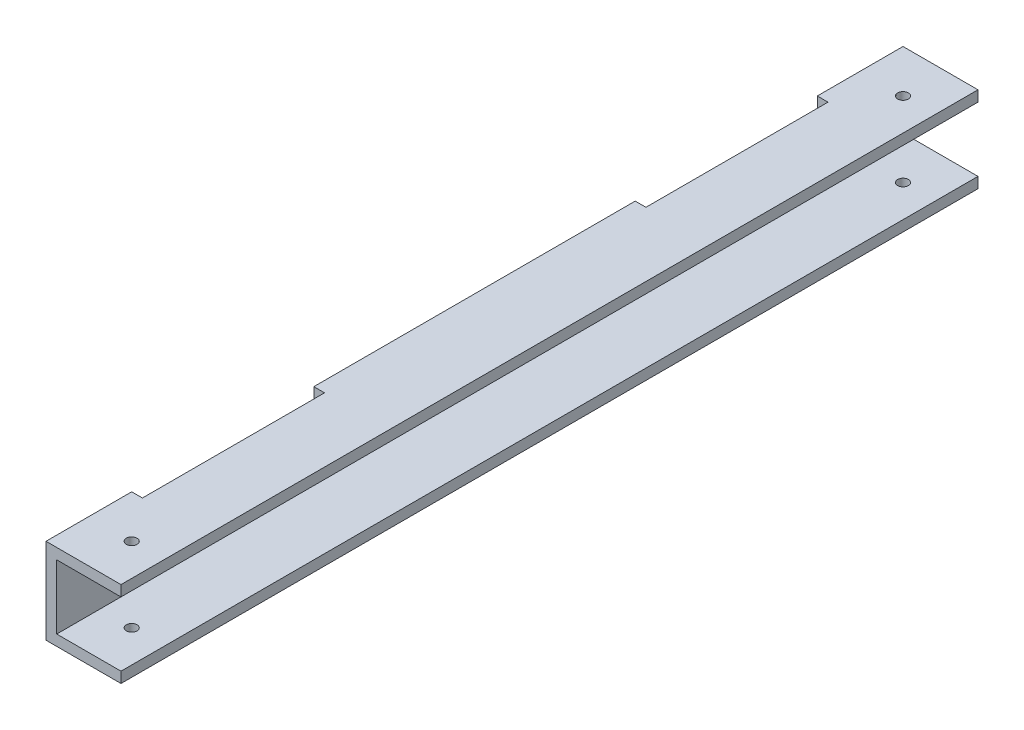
ISO-10303-21;
HEADER;
FILE_DESCRIPTION(('STEP AP214'),'2;1');
FILE_NAME('part.step','',(''),(''),'','','');
FILE_SCHEMA(('AUTOMOTIVE_DESIGN { 1 0 10303 214 1 1 1 1 }'));
ENDSEC;
DATA;
#1=APPLICATION_CONTEXT('core data for automotive mechanical design processes');
#2=APPLICATION_PROTOCOL_DEFINITION('international standard','automotive_design',2000,#1);
#3=PRODUCT_CONTEXT('',#1,'mechanical');
#4=PRODUCT('Part','Part','',(#3));
#5=PRODUCT_RELATED_PRODUCT_CATEGORY('part','',(#4));
#6=PRODUCT_DEFINITION_FORMATION('','',#4);
#7=PRODUCT_DEFINITION_CONTEXT('part definition',#1,'design');
#8=PRODUCT_DEFINITION('design','',#6,#7);
#9=PRODUCT_DEFINITION_SHAPE('','',#8);
#10=(LENGTH_UNIT() NAMED_UNIT(*) SI_UNIT(.MILLI.,.METRE.));
#11=(NAMED_UNIT(*) PLANE_ANGLE_UNIT() SI_UNIT($,.RADIAN.));
#12=(NAMED_UNIT(*) SI_UNIT($,.STERADIAN.) SOLID_ANGLE_UNIT());
#13=UNCERTAINTY_MEASURE_WITH_UNIT(LENGTH_MEASURE(1.E-05),#10,'distance_accuracy_value','');
#14=(GEOMETRIC_REPRESENTATION_CONTEXT(3) GLOBAL_UNCERTAINTY_ASSIGNED_CONTEXT((#13)) GLOBAL_UNIT_ASSIGNED_CONTEXT((#10,
#11,#12)) REPRESENTATION_CONTEXT('',''));
#15=CARTESIAN_POINT('',(0.,0.,0.));
#16=DIRECTION('',(0.,0.,1.));
#17=DIRECTION('',(1.,0.,0.));
#18=AXIS2_PLACEMENT_3D('',#15,#16,#17);
#19=CARTESIAN_POINT('',(-11.1125,-12.7,254.));
#20=DIRECTION('',(1.,0.,0.));
#21=DIRECTION('',(0.,0.,-1.));
#22=AXIS2_PLACEMENT_3D('',#19,#20,#21);
#23=PLANE('',#22);
#24=CARTESIAN_POINT('',(-11.1125,0.,161.925));
#25=DIRECTION('',(-1.,0.,0.));
#26=DIRECTION('',(0.,0.,-1.));
#27=AXIS2_PLACEMENT_3D('',#24,#25,#26);
#28=CIRCLE('',#27,1.58750000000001);
#29=CARTESIAN_POINT('',(-11.1125,0.,160.3375));
#30=VERTEX_POINT('',#29);
#31=EDGE_CURVE('E588',#30,#30,#28,.T.);
#32=ORIENTED_EDGE('',*,*,#31,.F.);
#33=EDGE_LOOP('',(#32));
#34=FACE_BOUND('',#33,.T.);
#35=CARTESIAN_POINT('',(-11.1125,0.,92.075));
#36=DIRECTION('',(-1.,0.,0.));
#37=DIRECTION('',(0.,0.,1.));
#38=AXIS2_PLACEMENT_3D('',#35,#36,#37);
#39=CIRCLE('',#38,1.5875);
#40=CARTESIAN_POINT('',(-11.1125,0.,93.6625));
#41=VERTEX_POINT('',#40);
#42=EDGE_CURVE('E587',#41,#41,#39,.T.);
#43=ORIENTED_EDGE('',*,*,#42,.F.);
#44=EDGE_LOOP('',(#43));
#45=FACE_BOUND('',#44,.T.);
#46=DIRECTION('',(0.,0.,-1.));
#47=VECTOR('',#46,1.);
#48=CARTESIAN_POINT('',(-11.1125,12.7,254.));
#49=LINE('',#48,#47);
#50=CARTESIAN_POINT('',(-11.1125,12.7,174.625));
#51=VERTEX_POINT('',#50);
#52=CARTESIAN_POINT('',(-11.1125,12.7,79.375));
#53=VERTEX_POINT('',#52);
#54=EDGE_CURVE('E364',#51,#53,#49,.T.);
#55=ORIENTED_EDGE('',*,*,#54,.T.);
#56=DIRECTION('',(0.,1.,0.));
#57=VECTOR('',#56,1.);
#58=CARTESIAN_POINT('',(-11.1125,-12.7,79.375));
#59=LINE('',#58,#57);
#60=CARTESIAN_POINT('',(-11.1125,-12.7,79.375));
#61=VERTEX_POINT('',#60);
#62=EDGE_CURVE('E230',#61,#53,#59,.T.);
#63=ORIENTED_EDGE('',*,*,#62,.F.);
#64=DIRECTION('',(0.,0.,-1.));
#65=VECTOR('',#64,1.);
#66=CARTESIAN_POINT('',(-11.1125,-12.7,254.));
#67=LINE('',#66,#65);
#68=CARTESIAN_POINT('',(-11.1125,-12.7,174.625));
#69=VERTEX_POINT('',#68);
#70=EDGE_CURVE('E49',#69,#61,#67,.T.);
#71=ORIENTED_EDGE('',*,*,#70,.F.);
#72=DIRECTION('',(0.,1.,0.));
#73=VECTOR('',#72,1.);
#74=CARTESIAN_POINT('',(-11.1125,-12.7,174.625));
#75=LINE('',#74,#73);
#76=EDGE_CURVE('E222',#69,#51,#75,.T.);
#77=ORIENTED_EDGE('',*,*,#76,.T.);
#78=EDGE_LOOP('',(#55,#63,#71,#77));
#79=FACE_BOUND('',#78,.T.);
#80=ADVANCED_FACE('F39',(#34,#45,#79),#23,.F.);
#81=CARTESIAN_POINT('',(-11.1125,0.,12.7));
#82=DIRECTION('',(-1.,0.,0.));
#83=DIRECTION('',(0.,0.,1.));
#84=AXIS2_PLACEMENT_3D('',#81,#82,#83);
#85=CIRCLE('',#84,1.58749999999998);
#86=CARTESIAN_POINT('',(-11.1125,0.,14.2875));
#87=VERTEX_POINT('',#86);
#88=EDGE_CURVE('E397',#87,#87,#85,.T.);
#89=ORIENTED_EDGE('',*,*,#88,.F.);
#90=EDGE_LOOP('',(#89));
#91=FACE_BOUND('',#90,.T.);
#92=CARTESIAN_POINT('',(-11.1125,-12.7,25.4));
#93=VERTEX_POINT('',#92);
#94=CARTESIAN_POINT('',(-11.1125,-12.7,0.));
#95=VERTEX_POINT('',#94);
#96=EDGE_CURVE('E51',#93,#95,#67,.T.);
#97=ORIENTED_EDGE('',*,*,#96,.F.);
#98=DIRECTION('',(0.,1.,0.));
#99=VECTOR('',#98,1.);
#100=CARTESIAN_POINT('',(-11.1125,-12.7,25.4));
#101=LINE('',#100,#99);
#102=CARTESIAN_POINT('',(-11.1125,12.7,25.4));
#103=VERTEX_POINT('',#102);
#104=EDGE_CURVE('E192',#93,#103,#101,.T.);
#105=ORIENTED_EDGE('',*,*,#104,.T.);
#106=CARTESIAN_POINT('',(-11.1125,12.7,0.));
#107=VERTEX_POINT('',#106);
#108=EDGE_CURVE('E332',#103,#107,#49,.T.);
#109=ORIENTED_EDGE('',*,*,#108,.T.);
#110=DIRECTION('',(0.,-1.,0.));
#111=VECTOR('',#110,1.);
#112=CARTESIAN_POINT('',(-11.1125,-12.7,0.));
#113=LINE('',#112,#111);
#114=EDGE_CURVE('E305',#107,#95,#113,.T.);
#115=ORIENTED_EDGE('',*,*,#114,.T.);
#116=EDGE_LOOP('',(#97,#105,#109,#115));
#117=FACE_BOUND('',#116,.T.);
#118=ADVANCED_FACE('F425',(#91,#117),#23,.F.);
#119=CARTESIAN_POINT('',(-7.9375,9.52499999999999,254.));
#120=DIRECTION('',(-1.,0.,0.));
#121=DIRECTION('',(0.,-1.,0.));
#122=AXIS2_PLACEMENT_3D('',#119,#120,#121);
#123=PLANE('',#122);
#124=CARTESIAN_POINT('',(-7.9375,0.,161.925));
#125=DIRECTION('',(-1.,0.,0.));
#126=DIRECTION('',(0.,-1.,0.));
#127=AXIS2_PLACEMENT_3D('',#124,#125,#126);
#128=CIRCLE('',#127,1.58750000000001);
#129=CARTESIAN_POINT('',(-7.9375,-1.58750000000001,161.925));
#130=VERTEX_POINT('',#129);
#131=EDGE_CURVE('E43',#130,#130,#128,.T.);
#132=ORIENTED_EDGE('',*,*,#131,.T.);
#133=EDGE_LOOP('',(#132));
#134=FACE_BOUND('',#133,.T.);
#135=CARTESIAN_POINT('',(-7.9375,0.,92.075));
#136=DIRECTION('',(-1.,0.,0.));
#137=DIRECTION('',(0.,-1.,0.));
#138=AXIS2_PLACEMENT_3D('',#135,#136,#137);
#139=CIRCLE('',#138,1.5875);
#140=CARTESIAN_POINT('',(-7.9375,-1.5875,92.075));
#141=VERTEX_POINT('',#140);
#142=EDGE_CURVE('E400',#141,#141,#139,.T.);
#143=ORIENTED_EDGE('',*,*,#142,.T.);
#144=EDGE_LOOP('',(#143));
#145=FACE_BOUND('',#144,.T.);
#146=DIRECTION('',(0.,0.,-1.));
#147=VECTOR('',#146,1.);
#148=CARTESIAN_POINT('',(-7.9375,-9.525,254.));
#149=LINE('',#148,#147);
#150=CARTESIAN_POINT('',(-7.9375,-9.525,174.625));
#151=VERTEX_POINT('',#150);
#152=CARTESIAN_POINT('',(-7.9375,-9.525,79.375));
#153=VERTEX_POINT('',#152);
#154=EDGE_CURVE('E384',#151,#153,#149,.T.);
#155=ORIENTED_EDGE('',*,*,#154,.T.);
#156=DIRECTION('',(0.,1.,0.));
#157=VECTOR('',#156,1.);
#158=CARTESIAN_POINT('',(-7.9375,-12.7,79.375));
#159=LINE('',#158,#157);
#160=CARTESIAN_POINT('',(-7.9375,9.525,79.375));
#161=VERTEX_POINT('',#160);
#162=EDGE_CURVE('E228',#153,#161,#159,.T.);
#163=ORIENTED_EDGE('',*,*,#162,.T.);
#164=DIRECTION('',(0.,0.,-1.));
#165=VECTOR('',#164,1.);
#166=CARTESIAN_POINT('',(-7.9375,9.52499999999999,254.));
#167=LINE('',#166,#165);
#168=CARTESIAN_POINT('',(-7.9375,9.52499999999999,174.625));
#169=VERTEX_POINT('',#168);
#170=EDGE_CURVE('E378',#169,#161,#167,.T.);
#171=ORIENTED_EDGE('',*,*,#170,.F.);
#172=DIRECTION('',(0.,1.,0.));
#173=VECTOR('',#172,1.);
#174=CARTESIAN_POINT('',(-7.9375,-12.7,174.625));
#175=LINE('',#174,#173);
#176=EDGE_CURVE('E66',#151,#169,#175,.T.);
#177=ORIENTED_EDGE('',*,*,#176,.F.);
#178=EDGE_LOOP('',(#155,#163,#171,#177));
#179=FACE_BOUND('',#178,.T.);
#180=ADVANCED_FACE('F409',(#134,#145,#179),#123,.F.);
#181=CARTESIAN_POINT('',(-7.9375,0.,12.7));
#182=DIRECTION('',(-1.,0.,0.));
#183=DIRECTION('',(0.,-1.,0.));
#184=AXIS2_PLACEMENT_3D('',#181,#182,#183);
#185=CIRCLE('',#184,1.58749999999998);
#186=CARTESIAN_POINT('',(-7.9375,-1.58749999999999,12.7));
#187=VERTEX_POINT('',#186);
#188=EDGE_CURVE('E396',#187,#187,#185,.T.);
#189=ORIENTED_EDGE('',*,*,#188,.T.);
#190=EDGE_LOOP('',(#189));
#191=FACE_BOUND('',#190,.T.);
#192=CARTESIAN_POINT('',(-7.9375,9.52499999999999,25.4));
#193=VERTEX_POINT('',#192);
#194=CARTESIAN_POINT('',(-7.9375,9.52499999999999,0.));
#195=VERTEX_POINT('',#194);
#196=EDGE_CURVE('E372',#193,#195,#167,.T.);
#197=ORIENTED_EDGE('',*,*,#196,.F.);
#198=DIRECTION('',(0.,1.,0.));
#199=VECTOR('',#198,1.);
#200=CARTESIAN_POINT('',(-7.93750000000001,-12.7,25.4));
#201=LINE('',#200,#199);
#202=CARTESIAN_POINT('',(-7.93750000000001,-9.525,25.4));
#203=VERTEX_POINT('',#202);
#204=EDGE_CURVE('E58',#203,#193,#201,.T.);
#205=ORIENTED_EDGE('',*,*,#204,.F.);
#206=CARTESIAN_POINT('',(-7.9375,-9.525,0.));
#207=VERTEX_POINT('',#206);
#208=EDGE_CURVE('E377',#203,#207,#149,.T.);
#209=ORIENTED_EDGE('',*,*,#208,.T.);
#210=DIRECTION('',(0.,1.,0.));
#211=VECTOR('',#210,1.);
#212=CARTESIAN_POINT('',(-7.9375,9.52499999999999,0.));
#213=LINE('',#212,#211);
#214=EDGE_CURVE('E346',#207,#195,#213,.T.);
#215=ORIENTED_EDGE('',*,*,#214,.T.);
#216=EDGE_LOOP('',(#197,#205,#209,#215));
#217=FACE_BOUND('',#216,.T.);
#218=ADVANCED_FACE('F434',(#191,#217),#123,.F.);
#219=CARTESIAN_POINT('',(-11.1125,0.,241.3));
#220=DIRECTION('',(-1.,0.,0.));
#221=DIRECTION('',(0.,0.,-1.));
#222=AXIS2_PLACEMENT_3D('',#219,#220,#221);
#223=CIRCLE('',#222,1.58749999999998);
#224=CARTESIAN_POINT('',(-11.1125,0.,239.7125));
#225=VERTEX_POINT('',#224);
#226=EDGE_CURVE('E448',#225,#225,#223,.T.);
#227=ORIENTED_EDGE('',*,*,#226,.F.);
#228=EDGE_LOOP('',(#227));
#229=FACE_BOUND('',#228,.T.);
#230=CARTESIAN_POINT('',(-11.1125,12.7,254.));
#231=VERTEX_POINT('',#230);
#232=CARTESIAN_POINT('',(-11.1125,12.7,228.6));
#233=VERTEX_POINT('',#232);
#234=EDGE_CURVE('E359',#231,#233,#49,.T.);
#235=ORIENTED_EDGE('',*,*,#234,.T.);
#236=DIRECTION('',(0.,1.,0.));
#237=VECTOR('',#236,1.);
#238=CARTESIAN_POINT('',(-11.1125,-12.7,228.6));
#239=LINE('',#238,#237);
#240=CARTESIAN_POINT('',(-11.1125,-12.7,228.6));
#241=VERTEX_POINT('',#240);
#242=EDGE_CURVE('E248',#241,#233,#239,.T.);
#243=ORIENTED_EDGE('',*,*,#242,.F.);
#244=CARTESIAN_POINT('',(-11.1125,-12.7,254.));
#245=VERTEX_POINT('',#244);
#246=EDGE_CURVE('E11',#245,#241,#67,.T.);
#247=ORIENTED_EDGE('',*,*,#246,.F.);
#248=DIRECTION('',(0.,-1.,0.));
#249=VECTOR('',#248,1.);
#250=CARTESIAN_POINT('',(-11.1125,-12.7,254.));
#251=LINE('',#250,#249);
#252=EDGE_CURVE('E306',#231,#245,#251,.T.);
#253=ORIENTED_EDGE('',*,*,#252,.F.);
#254=EDGE_LOOP('',(#235,#243,#247,#253));
#255=FACE_BOUND('',#254,.T.);
#256=ADVANCED_FACE('F41',(#229,#255),#23,.F.);
#257=CARTESIAN_POINT('',(11.1125,-12.7,254.));
#258=DIRECTION('',(0.,1.,0.));
#259=DIRECTION('',(0.,0.,1.));
#260=AXIS2_PLACEMENT_3D('',#257,#258,#259);
#261=PLANE('',#260);
#262=CARTESIAN_POINT('',(1.5875,-12.7,241.3));
#263=DIRECTION('',(0.,1.,0.));
#264=DIRECTION('',(0.,0.,1.));
#265=AXIS2_PLACEMENT_3D('',#262,#263,#264);
#266=CIRCLE('',#265,1.5875);
#267=CARTESIAN_POINT('',(1.5875,-12.7,242.8875));
#268=VERTEX_POINT('',#267);
#269=EDGE_CURVE('E279',#268,#268,#266,.T.);
#270=ORIENTED_EDGE('',*,*,#269,.T.);
#271=EDGE_LOOP('',(#270));
#272=FACE_BOUND('',#271,.T.);
#273=CARTESIAN_POINT('',(1.5875,-12.7,12.7));
#274=DIRECTION('',(0.,1.,0.));
#275=DIRECTION('',(0.,0.,1.));
#276=AXIS2_PLACEMENT_3D('',#273,#274,#275);
#277=CIRCLE('',#276,1.5875);
#278=CARTESIAN_POINT('',(1.5875,-12.7,14.2875));
#279=VERTEX_POINT('',#278);
#280=EDGE_CURVE('E602',#279,#279,#277,.T.);
#281=ORIENTED_EDGE('',*,*,#280,.T.);
#282=EDGE_LOOP('',(#281));
#283=FACE_BOUND('',#282,.T.);
#284=ORIENTED_EDGE('',*,*,#70,.T.);
#285=DIRECTION('',(1.,0.,0.));
#286=VECTOR('',#285,1.);
#287=CARTESIAN_POINT('',(-7.9375,-12.7,79.375));
#288=LINE('',#287,#286);
#289=CARTESIAN_POINT('',(-7.9375,-12.7,79.375));
#290=VERTEX_POINT('',#289);
#291=EDGE_CURVE('E202',#61,#290,#288,.T.);
#292=ORIENTED_EDGE('',*,*,#291,.T.);
#293=DIRECTION('',(0.,0.,-1.));
#294=VECTOR('',#293,1.);
#295=CARTESIAN_POINT('',(-7.93750000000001,-12.7,25.4));
#296=LINE('',#295,#294);
#297=CARTESIAN_POINT('',(-7.93750000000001,-12.7,25.4));
#298=VERTEX_POINT('',#297);
#299=EDGE_CURVE('E187',#290,#298,#296,.T.);
#300=ORIENTED_EDGE('',*,*,#299,.T.);
#301=DIRECTION('',(-1.,0.,0.));
#302=VECTOR('',#301,1.);
#303=CARTESIAN_POINT('',(-7.93750000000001,-12.7,25.4));
#304=LINE('',#303,#302);
#305=EDGE_CURVE('E196',#298,#93,#304,.T.);
#306=ORIENTED_EDGE('',*,*,#305,.T.);
#307=ORIENTED_EDGE('',*,*,#96,.T.);
#308=DIRECTION('',(1.,0.,0.));
#309=VECTOR('',#308,1.);
#310=CARTESIAN_POINT('',(11.1125,-12.7,0.));
#311=LINE('',#310,#309);
#312=CARTESIAN_POINT('',(11.1125,-12.7,0.));
#313=VERTEX_POINT('',#312);
#314=EDGE_CURVE('E336',#95,#313,#311,.T.);
#315=ORIENTED_EDGE('',*,*,#314,.T.);
#316=DIRECTION('',(0.,0.,-1.));
#317=VECTOR('',#316,1.);
#318=CARTESIAN_POINT('',(11.1125,-12.7,254.));
#319=LINE('',#318,#317);
#320=CARTESIAN_POINT('',(11.1125,-12.7,254.));
#321=VERTEX_POINT('',#320);
#322=EDGE_CURVE('E388',#321,#313,#319,.T.);
#323=ORIENTED_EDGE('',*,*,#322,.F.);
#324=DIRECTION('',(1.,0.,0.));
#325=VECTOR('',#324,1.);
#326=CARTESIAN_POINT('',(11.1125,-12.7,254.));
#327=LINE('',#326,#325);
#328=EDGE_CURVE('E310',#245,#321,#327,.T.);
#329=ORIENTED_EDGE('',*,*,#328,.F.);
#330=ORIENTED_EDGE('',*,*,#246,.T.);
#331=DIRECTION('',(1.,0.,0.));
#332=VECTOR('',#331,1.);
#333=CARTESIAN_POINT('',(-11.1125,-12.7,228.6));
#334=LINE('',#333,#332);
#335=CARTESIAN_POINT('',(-7.9375,-12.7,228.6));
#336=VERTEX_POINT('',#335);
#337=EDGE_CURVE('E235',#241,#336,#334,.T.);
#338=ORIENTED_EDGE('',*,*,#337,.T.);
#339=DIRECTION('',(0.,0.,-1.));
#340=VECTOR('',#339,1.);
#341=CARTESIAN_POINT('',(-7.9375,-12.7,228.6));
#342=LINE('',#341,#340);
#343=CARTESIAN_POINT('',(-7.9375,-12.7,174.625));
#344=VERTEX_POINT('',#343);
#345=EDGE_CURVE('E239',#336,#344,#342,.T.);
#346=ORIENTED_EDGE('',*,*,#345,.T.);
#347=DIRECTION('',(-1.,0.,0.));
#348=VECTOR('',#347,1.);
#349=CARTESIAN_POINT('',(-11.1125,-12.7,174.625));
#350=LINE('',#349,#348);
#351=EDGE_CURVE('E244',#344,#69,#350,.T.);
#352=ORIENTED_EDGE('',*,*,#351,.T.);
#353=EDGE_LOOP('',(#284,#292,#300,#306,#307,#315,#323,#329,#330,#338,#346,#352));
#354=FACE_BOUND('',#353,.T.);
#355=ADVANCED_FACE('F205',(#272,#283,#354),#261,.F.);
#356=CARTESIAN_POINT('',(11.1125,-12.7,254.));
#357=DIRECTION('',(-1.,0.,0.));
#358=DIRECTION('',(0.,-1.,0.));
#359=AXIS2_PLACEMENT_3D('',#356,#357,#358);
#360=PLANE('',#359);
#361=DIRECTION('',(0.,1.,0.));
#362=VECTOR('',#361,1.);
#363=CARTESIAN_POINT('',(11.1125,-12.7,0.));
#364=LINE('',#363,#362);
#365=CARTESIAN_POINT('',(11.1125,-9.525,0.));
#366=VERTEX_POINT('',#365);
#367=EDGE_CURVE('E339',#313,#366,#364,.T.);
#368=ORIENTED_EDGE('',*,*,#367,.T.);
#369=DIRECTION('',(0.,0.,-1.));
#370=VECTOR('',#369,1.);
#371=CARTESIAN_POINT('',(11.1125,-9.525,254.));
#372=LINE('',#371,#370);
#373=CARTESIAN_POINT('',(11.1125,-9.525,254.));
#374=VERTEX_POINT('',#373);
#375=EDGE_CURVE('E383',#374,#366,#372,.T.);
#376=ORIENTED_EDGE('',*,*,#375,.F.);
#377=DIRECTION('',(0.,1.,0.));
#378=VECTOR('',#377,1.);
#379=CARTESIAN_POINT('',(11.1125,-12.7,254.));
#380=LINE('',#379,#378);
#381=EDGE_CURVE('E314',#321,#374,#380,.T.);
#382=ORIENTED_EDGE('',*,*,#381,.F.);
#383=ORIENTED_EDGE('',*,*,#322,.T.);
#384=EDGE_LOOP('',(#368,#376,#382,#383));
#385=FACE_BOUND('',#384,.T.);
#386=ADVANCED_FACE('F440',(#385),#360,.F.);
#387=CARTESIAN_POINT('',(-7.9375,-9.525,254.));
#388=DIRECTION('',(0.,-1.,0.));
#389=DIRECTION('',(0.,0.,-1.));
#390=AXIS2_PLACEMENT_3D('',#387,#388,#389);
#391=PLANE('',#390);
#392=CARTESIAN_POINT('',(1.5875,-9.525,241.3));
#393=DIRECTION('',(0.,-1.,0.));
#394=DIRECTION('',(0.,0.,-1.));
#395=AXIS2_PLACEMENT_3D('',#392,#393,#394);
#396=CIRCLE('',#395,1.5875);
#397=CARTESIAN_POINT('',(1.5875,-9.525,239.7125));
#398=VERTEX_POINT('',#397);
#399=EDGE_CURVE('E301',#398,#398,#396,.T.);
#400=ORIENTED_EDGE('',*,*,#399,.T.);
#401=EDGE_LOOP('',(#400));
#402=FACE_BOUND('',#401,.T.);
#403=CARTESIAN_POINT('',(1.5875,-9.525,12.7));
#404=DIRECTION('',(0.,-1.,0.));
#405=DIRECTION('',(0.,0.,-1.));
#406=AXIS2_PLACEMENT_3D('',#403,#404,#405);
#407=CIRCLE('',#406,1.5875);
#408=CARTESIAN_POINT('',(1.5875,-9.525,11.1125));
#409=VERTEX_POINT('',#408);
#410=EDGE_CURVE('E293',#409,#409,#407,.T.);
#411=ORIENTED_EDGE('',*,*,#410,.T.);
#412=EDGE_LOOP('',(#411));
#413=FACE_BOUND('',#412,.T.);
#414=DIRECTION('',(-1.,0.,0.));
#415=VECTOR('',#414,1.);
#416=CARTESIAN_POINT('',(-7.9375,-9.525,0.));
#417=LINE('',#416,#415);
#418=EDGE_CURVE('E342',#366,#207,#417,.T.);
#419=ORIENTED_EDGE('',*,*,#418,.T.);
#420=ORIENTED_EDGE('',*,*,#208,.F.);
#421=DIRECTION('',(0.,0.,1.));
#422=VECTOR('',#421,1.);
#423=CARTESIAN_POINT('',(-7.9375,-9.525,254.));
#424=LINE('',#423,#422);
#425=EDGE_CURVE('E190',#203,#153,#424,.T.);
#426=ORIENTED_EDGE('',*,*,#425,.T.);
#427=ORIENTED_EDGE('',*,*,#154,.F.);
#428=DIRECTION('',(0.,0.,1.));
#429=VECTOR('',#428,1.);
#430=CARTESIAN_POINT('',(-7.9375,-9.525,254.));
#431=LINE('',#430,#429);
#432=CARTESIAN_POINT('',(-7.9375,-9.525,228.6));
#433=VERTEX_POINT('',#432);
#434=EDGE_CURVE('E278',#151,#433,#431,.T.);
#435=ORIENTED_EDGE('',*,*,#434,.T.);
#436=CARTESIAN_POINT('',(-7.9375,-9.525,254.));
#437=VERTEX_POINT('',#436);
#438=EDGE_CURVE('E379',#437,#433,#149,.T.);
#439=ORIENTED_EDGE('',*,*,#438,.F.);
#440=DIRECTION('',(-1.,0.,0.));
#441=VECTOR('',#440,1.);
#442=CARTESIAN_POINT('',(-7.9375,-9.525,254.));
#443=LINE('',#442,#441);
#444=EDGE_CURVE('E317',#374,#437,#443,.T.);
#445=ORIENTED_EDGE('',*,*,#444,.F.);
#446=ORIENTED_EDGE('',*,*,#375,.T.);
#447=EDGE_LOOP('',(#419,#420,#426,#427,#435,#439,#445,#446));
#448=FACE_BOUND('',#447,.T.);
#449=ADVANCED_FACE('F502',(#402,#413,#448),#391,.F.);
#450=CARTESIAN_POINT('',(-7.9375,0.,241.3));
#451=DIRECTION('',(-1.,0.,0.));
#452=DIRECTION('',(0.,-1.,0.));
#453=AXIS2_PLACEMENT_3D('',#450,#451,#452);
#454=CIRCLE('',#453,1.58749999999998);
#455=CARTESIAN_POINT('',(-7.9375,-1.58749999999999,241.3));
#456=VERTEX_POINT('',#455);
#457=EDGE_CURVE('E392',#456,#456,#454,.T.);
#458=ORIENTED_EDGE('',*,*,#457,.T.);
#459=EDGE_LOOP('',(#458));
#460=FACE_BOUND('',#459,.T.);
#461=ORIENTED_EDGE('',*,*,#438,.T.);
#462=DIRECTION('',(0.,1.,0.));
#463=VECTOR('',#462,1.);
#464=CARTESIAN_POINT('',(-7.9375,-12.7,228.6));
#465=LINE('',#464,#463);
#466=CARTESIAN_POINT('',(-7.9375,9.525,228.6));
#467=VERTEX_POINT('',#466);
#468=EDGE_CURVE('E270',#433,#467,#465,.T.);
#469=ORIENTED_EDGE('',*,*,#468,.T.);
#470=CARTESIAN_POINT('',(-7.9375,9.52499999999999,254.));
#471=VERTEX_POINT('',#470);
#472=EDGE_CURVE('E373',#471,#467,#167,.T.);
#473=ORIENTED_EDGE('',*,*,#472,.F.);
#474=DIRECTION('',(0.,1.,0.));
#475=VECTOR('',#474,1.);
#476=CARTESIAN_POINT('',(-7.9375,9.52499999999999,254.));
#477=LINE('',#476,#475);
#478=EDGE_CURVE('E320',#437,#471,#477,.T.);
#479=ORIENTED_EDGE('',*,*,#478,.F.);
#480=EDGE_LOOP('',(#461,#469,#473,#479));
#481=FACE_BOUND('',#480,.T.);
#482=ADVANCED_FACE('F444',(#460,#481),#123,.F.);
#483=CARTESIAN_POINT('',(-7.9375,9.52499999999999,254.));
#484=DIRECTION('',(0.,1.,0.));
#485=DIRECTION('',(0.,0.,1.));
#486=AXIS2_PLACEMENT_3D('',#483,#484,#485);
#487=PLANE('',#486);
#488=CARTESIAN_POINT('',(1.5875,9.525,241.3));
#489=DIRECTION('',(0.,1.,0.));
#490=DIRECTION('',(0.,0.,1.));
#491=AXIS2_PLACEMENT_3D('',#488,#489,#490);
#492=CIRCLE('',#491,1.5875);
#493=CARTESIAN_POINT('',(1.5875,9.525,242.8875));
#494=VERTEX_POINT('',#493);
#495=EDGE_CURVE('E297',#494,#494,#492,.T.);
#496=ORIENTED_EDGE('',*,*,#495,.T.);
#497=EDGE_LOOP('',(#496));
#498=FACE_BOUND('',#497,.T.);
#499=CARTESIAN_POINT('',(1.5875,9.525,12.7));
#500=DIRECTION('',(0.,1.,0.));
#501=DIRECTION('',(0.,0.,1.));
#502=AXIS2_PLACEMENT_3D('',#499,#500,#501);
#503=CIRCLE('',#502,1.5875);
#504=CARTESIAN_POINT('',(1.5875,9.525,14.2875));
#505=VERTEX_POINT('',#504);
#506=EDGE_CURVE('E289',#505,#505,#503,.T.);
#507=ORIENTED_EDGE('',*,*,#506,.T.);
#508=EDGE_LOOP('',(#507));
#509=FACE_BOUND('',#508,.T.);
#510=DIRECTION('',(1.,0.,0.));
#511=VECTOR('',#510,1.);
#512=CARTESIAN_POINT('',(-7.9375,9.52499999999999,0.));
#513=LINE('',#512,#511);
#514=CARTESIAN_POINT('',(11.1125,9.52499999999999,0.));
#515=VERTEX_POINT('',#514);
#516=EDGE_CURVE('E350',#195,#515,#513,.T.);
#517=ORIENTED_EDGE('',*,*,#516,.T.);
#518=DIRECTION('',(0.,0.,-1.));
#519=VECTOR('',#518,1.);
#520=CARTESIAN_POINT('',(11.1125,9.52499999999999,254.));
#521=LINE('',#520,#519);
#522=CARTESIAN_POINT('',(11.1125,9.52499999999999,254.));
#523=VERTEX_POINT('',#522);
#524=EDGE_CURVE('E368',#523,#515,#521,.T.);
#525=ORIENTED_EDGE('',*,*,#524,.F.);
#526=DIRECTION('',(1.,0.,0.));
#527=VECTOR('',#526,1.);
#528=CARTESIAN_POINT('',(-7.9375,9.52499999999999,254.));
#529=LINE('',#528,#527);
#530=EDGE_CURVE('E323',#471,#523,#529,.T.);
#531=ORIENTED_EDGE('',*,*,#530,.F.);
#532=ORIENTED_EDGE('',*,*,#472,.T.);
#533=DIRECTION('',(0.,0.,-1.));
#534=VECTOR('',#533,1.);
#535=CARTESIAN_POINT('',(-7.9375,9.52499999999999,254.));
#536=LINE('',#535,#534);
#537=EDGE_CURVE('E274',#467,#169,#536,.T.);
#538=ORIENTED_EDGE('',*,*,#537,.T.);
#539=ORIENTED_EDGE('',*,*,#170,.T.);
#540=DIRECTION('',(0.,0.,-1.));
#541=VECTOR('',#540,1.);
#542=CARTESIAN_POINT('',(-7.9375,9.52499999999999,254.));
#543=LINE('',#542,#541);
#544=EDGE_CURVE('E283',#161,#193,#543,.T.);
#545=ORIENTED_EDGE('',*,*,#544,.T.);
#546=ORIENTED_EDGE('',*,*,#196,.T.);
#547=EDGE_LOOP('',(#517,#525,#531,#532,#538,#539,#545,#546));
#548=FACE_BOUND('',#547,.T.);
#549=ADVANCED_FACE('F515',(#498,#509,#548),#487,.F.);
#550=CARTESIAN_POINT('',(11.1125,9.52499999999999,254.));
#551=DIRECTION('',(-1.,0.,0.));
#552=DIRECTION('',(0.,-1.,0.));
#553=AXIS2_PLACEMENT_3D('',#550,#551,#552);
#554=PLANE('',#553);
#555=DIRECTION('',(0.,1.,0.));
#556=VECTOR('',#555,1.);
#557=CARTESIAN_POINT('',(11.1125,9.52499999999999,0.));
#558=LINE('',#557,#556);
#559=CARTESIAN_POINT('',(11.1125,12.7,0.));
#560=VERTEX_POINT('',#559);
#561=EDGE_CURVE('E353',#515,#560,#558,.T.);
#562=ORIENTED_EDGE('',*,*,#561,.T.);
#563=DIRECTION('',(0.,0.,-1.));
#564=VECTOR('',#563,1.);
#565=CARTESIAN_POINT('',(11.1125,12.7,254.));
#566=LINE('',#565,#564);
#567=CARTESIAN_POINT('',(11.1125,12.7,254.));
#568=VERTEX_POINT('',#567);
#569=EDGE_CURVE('E363',#568,#560,#566,.T.);
#570=ORIENTED_EDGE('',*,*,#569,.F.);
#571=DIRECTION('',(0.,1.,0.));
#572=VECTOR('',#571,1.);
#573=CARTESIAN_POINT('',(11.1125,9.52499999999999,254.));
#574=LINE('',#573,#572);
#575=EDGE_CURVE('E326',#523,#568,#574,.T.);
#576=ORIENTED_EDGE('',*,*,#575,.F.);
#577=ORIENTED_EDGE('',*,*,#524,.T.);
#578=EDGE_LOOP('',(#562,#570,#576,#577));
#579=FACE_BOUND('',#578,.T.);
#580=ADVANCED_FACE('F474',(#579),#554,.F.);
#581=CARTESIAN_POINT('',(11.1125,12.7,254.));
#582=DIRECTION('',(0.,-1.,0.));
#583=DIRECTION('',(0.,0.,-1.));
#584=AXIS2_PLACEMENT_3D('',#581,#582,#583);
#585=PLANE('',#584);
#586=CARTESIAN_POINT('',(1.5875,12.7,241.3));
#587=DIRECTION('',(0.,1.,0.));
#588=DIRECTION('',(0.,0.,1.));
#589=AXIS2_PLACEMENT_3D('',#586,#587,#588);
#590=CIRCLE('',#589,1.5875);
#591=CARTESIAN_POINT('',(1.5875,12.7,242.8875));
#592=VERTEX_POINT('',#591);
#593=EDGE_CURVE('E599',#592,#592,#590,.T.);
#594=ORIENTED_EDGE('',*,*,#593,.F.);
#595=EDGE_LOOP('',(#594));
#596=FACE_BOUND('',#595,.T.);
#597=CARTESIAN_POINT('',(1.5875,12.7,12.7));
#598=DIRECTION('',(0.,1.,0.));
#599=DIRECTION('',(0.,0.,1.));
#600=AXIS2_PLACEMENT_3D('',#597,#598,#599);
#601=CIRCLE('',#600,1.5875);
#602=CARTESIAN_POINT('',(1.5875,12.7,14.2875));
#603=VERTEX_POINT('',#602);
#604=EDGE_CURVE('E214',#603,#603,#601,.T.);
#605=ORIENTED_EDGE('',*,*,#604,.F.);
#606=EDGE_LOOP('',(#605));
#607=FACE_BOUND('',#606,.T.);
#608=DIRECTION('',(0.,0.,-1.));
#609=VECTOR('',#608,1.);
#610=CARTESIAN_POINT('',(-7.93750000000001,12.7,25.4));
#611=LINE('',#610,#609);
#612=CARTESIAN_POINT('',(-7.9375,12.7,79.375));
#613=VERTEX_POINT('',#612);
#614=CARTESIAN_POINT('',(-7.93750000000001,12.7,25.4));
#615=VERTEX_POINT('',#614);
#616=EDGE_CURVE('E219',#613,#615,#611,.T.);
#617=ORIENTED_EDGE('',*,*,#616,.F.);
#618=DIRECTION('',(1.,0.,0.));
#619=VECTOR('',#618,1.);
#620=CARTESIAN_POINT('',(-7.9375,12.7,79.375));
#621=LINE('',#620,#619);
#622=EDGE_CURVE('E207',#53,#613,#621,.T.);
#623=ORIENTED_EDGE('',*,*,#622,.F.);
#624=ORIENTED_EDGE('',*,*,#54,.F.);
#625=DIRECTION('',(-1.,0.,0.));
#626=VECTOR('',#625,1.);
#627=CARTESIAN_POINT('',(-11.1125,12.7,174.625));
#628=LINE('',#627,#626);
#629=CARTESIAN_POINT('',(-7.9375,12.7,174.625));
#630=VERTEX_POINT('',#629);
#631=EDGE_CURVE('E240',#630,#51,#628,.T.);
#632=ORIENTED_EDGE('',*,*,#631,.F.);
#633=DIRECTION('',(0.,0.,-1.));
#634=VECTOR('',#633,1.);
#635=CARTESIAN_POINT('',(-7.9375,12.7,228.6));
#636=LINE('',#635,#634);
#637=CARTESIAN_POINT('',(-7.9375,12.7,228.6));
#638=VERTEX_POINT('',#637);
#639=EDGE_CURVE('E253',#638,#630,#636,.T.);
#640=ORIENTED_EDGE('',*,*,#639,.F.);
#641=DIRECTION('',(1.,0.,0.));
#642=VECTOR('',#641,1.);
#643=CARTESIAN_POINT('',(-11.1125,12.7,228.6));
#644=LINE('',#643,#642);
#645=EDGE_CURVE('E249',#233,#638,#644,.T.);
#646=ORIENTED_EDGE('',*,*,#645,.F.);
#647=ORIENTED_EDGE('',*,*,#234,.F.);
#648=DIRECTION('',(-1.,0.,0.));
#649=VECTOR('',#648,1.);
#650=CARTESIAN_POINT('',(11.1125,12.7,254.));
#651=LINE('',#650,#649);
#652=EDGE_CURVE('E329',#568,#231,#651,.T.);
#653=ORIENTED_EDGE('',*,*,#652,.F.);
#654=ORIENTED_EDGE('',*,*,#569,.T.);
#655=DIRECTION('',(-1.,0.,0.));
#656=VECTOR('',#655,1.);
#657=CARTESIAN_POINT('',(11.1125,12.7,0.));
#658=LINE('',#657,#656);
#659=EDGE_CURVE('E311',#560,#107,#658,.T.);
#660=ORIENTED_EDGE('',*,*,#659,.T.);
#661=ORIENTED_EDGE('',*,*,#108,.F.);
#662=DIRECTION('',(-1.,0.,0.));
#663=VECTOR('',#662,1.);
#664=CARTESIAN_POINT('',(-7.93750000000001,12.7,25.4));
#665=LINE('',#664,#663);
#666=EDGE_CURVE('E211',#615,#103,#665,.T.);
#667=ORIENTED_EDGE('',*,*,#666,.F.);
#668=EDGE_LOOP('',(#617,#623,#624,#632,#640,#646,#647,#653,#654,#660,#661,#667));
#669=FACE_BOUND('',#668,.T.);
#670=ADVANCED_FACE('F457',(#596,#607,#669),#585,.F.);
#671=CARTESIAN_POINT('',(0.,0.,254.));
#672=DIRECTION('',(0.,0.,1.));
#673=DIRECTION('',(1.,0.,0.));
#674=AXIS2_PLACEMENT_3D('',#671,#672,#673);
#675=PLANE('',#674);
#676=ORIENTED_EDGE('',*,*,#252,.T.);
#677=ORIENTED_EDGE('',*,*,#328,.T.);
#678=ORIENTED_EDGE('',*,*,#381,.T.);
#679=ORIENTED_EDGE('',*,*,#444,.T.);
#680=ORIENTED_EDGE('',*,*,#478,.T.);
#681=ORIENTED_EDGE('',*,*,#530,.T.);
#682=ORIENTED_EDGE('',*,*,#575,.T.);
#683=ORIENTED_EDGE('',*,*,#652,.T.);
#684=EDGE_LOOP('',(#676,#677,#678,#679,#680,#681,#682,#683));
#685=FACE_BOUND('',#684,.T.);
#686=ADVANCED_FACE('F468',(#685),#675,.T.);
#687=CARTESIAN_POINT('',(0.,0.,0.));
#688=DIRECTION('',(0.,0.,1.));
#689=DIRECTION('',(1.,0.,0.));
#690=AXIS2_PLACEMENT_3D('',#687,#688,#689);
#691=PLANE('',#690);
#692=ORIENTED_EDGE('',*,*,#114,.F.);
#693=ORIENTED_EDGE('',*,*,#659,.F.);
#694=ORIENTED_EDGE('',*,*,#561,.F.);
#695=ORIENTED_EDGE('',*,*,#516,.F.);
#696=ORIENTED_EDGE('',*,*,#214,.F.);
#697=ORIENTED_EDGE('',*,*,#418,.F.);
#698=ORIENTED_EDGE('',*,*,#367,.F.);
#699=ORIENTED_EDGE('',*,*,#314,.F.);
#700=EDGE_LOOP('',(#692,#693,#694,#695,#696,#697,#698,#699));
#701=FACE_BOUND('',#700,.T.);
#702=ADVANCED_FACE('F480',(#701),#691,.F.);
#703=CARTESIAN_POINT('',(-7.9375,-12.7,228.6));
#704=DIRECTION('',(1.,0.,0.));
#705=DIRECTION('',(0.,0.,-1.));
#706=AXIS2_PLACEMENT_3D('',#703,#704,#705);
#707=PLANE('',#706);
#708=EDGE_CURVE('E262',#344,#151,#175,.T.);
#709=ORIENTED_EDGE('',*,*,#708,.F.);
#710=ORIENTED_EDGE('',*,*,#345,.F.);
#711=EDGE_CURVE('E266',#336,#433,#465,.T.);
#712=ORIENTED_EDGE('',*,*,#711,.T.);
#713=ORIENTED_EDGE('',*,*,#434,.F.);
#714=EDGE_LOOP('',(#709,#710,#712,#713));
#715=FACE_BOUND('',#714,.T.);
#716=ADVANCED_FACE('F529',(#715),#707,.F.);
#717=EDGE_CURVE('E271',#467,#638,#465,.T.);
#718=ORIENTED_EDGE('',*,*,#717,.T.);
#719=ORIENTED_EDGE('',*,*,#639,.T.);
#720=EDGE_CURVE('E265',#169,#630,#175,.T.);
#721=ORIENTED_EDGE('',*,*,#720,.F.);
#722=ORIENTED_EDGE('',*,*,#537,.F.);
#723=EDGE_LOOP('',(#718,#719,#721,#722));
#724=FACE_BOUND('',#723,.T.);
#725=ADVANCED_FACE('F520',(#724),#707,.F.);
#726=CARTESIAN_POINT('',(-11.1125,-12.7,174.625));
#727=DIRECTION('',(0.,0.,-1.));
#728=DIRECTION('',(-1.,0.,0.));
#729=AXIS2_PLACEMENT_3D('',#726,#727,#728);
#730=PLANE('',#729);
#731=ORIENTED_EDGE('',*,*,#631,.T.);
#732=ORIENTED_EDGE('',*,*,#76,.F.);
#733=ORIENTED_EDGE('',*,*,#351,.F.);
#734=ORIENTED_EDGE('',*,*,#708,.T.);
#735=ORIENTED_EDGE('',*,*,#176,.T.);
#736=ORIENTED_EDGE('',*,*,#720,.T.);
#737=EDGE_LOOP('',(#731,#732,#733,#734,#735,#736));
#738=FACE_BOUND('',#737,.T.);
#739=ADVANCED_FACE('F555',(#738),#730,.F.);
#740=CARTESIAN_POINT('',(-11.1125,-12.7,228.6));
#741=DIRECTION('',(0.,0.,1.));
#742=DIRECTION('',(1.,0.,0.));
#743=AXIS2_PLACEMENT_3D('',#740,#741,#742);
#744=PLANE('',#743);
#745=ORIENTED_EDGE('',*,*,#645,.T.);
#746=ORIENTED_EDGE('',*,*,#717,.F.);
#747=ORIENTED_EDGE('',*,*,#468,.F.);
#748=ORIENTED_EDGE('',*,*,#711,.F.);
#749=ORIENTED_EDGE('',*,*,#337,.F.);
#750=ORIENTED_EDGE('',*,*,#242,.T.);
#751=EDGE_LOOP('',(#745,#746,#747,#748,#749,#750));
#752=FACE_BOUND('',#751,.T.);
#753=ADVANCED_FACE('F462',(#752),#744,.F.);
#754=CARTESIAN_POINT('',(-7.93750000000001,-12.7,25.4));
#755=DIRECTION('',(1.,0.,0.));
#756=DIRECTION('',(0.,0.,-1.));
#757=AXIS2_PLACEMENT_3D('',#754,#755,#756);
#758=PLANE('',#757);
#759=EDGE_CURVE('E182',#298,#203,#201,.T.);
#760=ORIENTED_EDGE('',*,*,#759,.F.);
#761=ORIENTED_EDGE('',*,*,#299,.F.);
#762=EDGE_CURVE('E225',#290,#153,#159,.T.);
#763=ORIENTED_EDGE('',*,*,#762,.T.);
#764=ORIENTED_EDGE('',*,*,#425,.F.);
#765=EDGE_LOOP('',(#760,#761,#763,#764));
#766=FACE_BOUND('',#765,.T.);
#767=ADVANCED_FACE('F184',(#766),#758,.F.);
#768=EDGE_CURVE('E229',#161,#613,#159,.T.);
#769=ORIENTED_EDGE('',*,*,#768,.T.);
#770=ORIENTED_EDGE('',*,*,#616,.T.);
#771=EDGE_CURVE('E194',#193,#615,#201,.T.);
#772=ORIENTED_EDGE('',*,*,#771,.F.);
#773=ORIENTED_EDGE('',*,*,#544,.F.);
#774=EDGE_LOOP('',(#769,#770,#772,#773));
#775=FACE_BOUND('',#774,.T.);
#776=ADVANCED_FACE('F562',(#775),#758,.F.);
#777=CARTESIAN_POINT('',(-7.9375,-12.7,79.375));
#778=DIRECTION('',(0.,0.,1.));
#779=DIRECTION('',(1.,0.,0.));
#780=AXIS2_PLACEMENT_3D('',#777,#778,#779);
#781=PLANE('',#780);
#782=ORIENTED_EDGE('',*,*,#622,.T.);
#783=ORIENTED_EDGE('',*,*,#768,.F.);
#784=ORIENTED_EDGE('',*,*,#162,.F.);
#785=ORIENTED_EDGE('',*,*,#762,.F.);
#786=ORIENTED_EDGE('',*,*,#291,.F.);
#787=ORIENTED_EDGE('',*,*,#62,.T.);
#788=EDGE_LOOP('',(#782,#783,#784,#785,#786,#787));
#789=FACE_BOUND('',#788,.T.);
#790=ADVANCED_FACE('F496',(#789),#781,.F.);
#791=CARTESIAN_POINT('',(-7.93750000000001,-12.7,25.4));
#792=DIRECTION('',(0.,0.,-1.));
#793=DIRECTION('',(-1.,0.,0.));
#794=AXIS2_PLACEMENT_3D('',#791,#792,#793);
#795=PLANE('',#794);
#796=ORIENTED_EDGE('',*,*,#666,.T.);
#797=ORIENTED_EDGE('',*,*,#104,.F.);
#798=ORIENTED_EDGE('',*,*,#305,.F.);
#799=ORIENTED_EDGE('',*,*,#759,.T.);
#800=ORIENTED_EDGE('',*,*,#204,.T.);
#801=ORIENTED_EDGE('',*,*,#771,.T.);
#802=EDGE_LOOP('',(#796,#797,#798,#799,#800,#801));
#803=FACE_BOUND('',#802,.T.);
#804=ADVANCED_FACE('F197',(#803),#795,.F.);
#805=CARTESIAN_POINT('',(1.5875,-12.7,12.7));
#806=DIRECTION('',(0.,1.,0.));
#807=DIRECTION('',(0.,0.,1.));
#808=AXIS2_PLACEMENT_3D('',#805,#806,#807);
#809=CYLINDRICAL_SURFACE('',#808,1.5875);
#810=ORIENTED_EDGE('',*,*,#604,.T.);
#811=EDGE_LOOP('',(#810));
#812=FACE_BOUND('',#811,.T.);
#813=ORIENTED_EDGE('',*,*,#506,.F.);
#814=EDGE_LOOP('',(#813));
#815=FACE_BOUND('',#814,.T.);
#816=ADVANCED_FACE('F565',(#812,#815),#809,.F.);
#817=CARTESIAN_POINT('',(1.5875,-12.7,241.3));
#818=DIRECTION('',(0.,1.,0.));
#819=DIRECTION('',(0.,0.,1.));
#820=AXIS2_PLACEMENT_3D('',#817,#818,#819);
#821=CYLINDRICAL_SURFACE('',#820,1.5875);
#822=ORIENTED_EDGE('',*,*,#593,.T.);
#823=EDGE_LOOP('',(#822));
#824=FACE_BOUND('',#823,.T.);
#825=ORIENTED_EDGE('',*,*,#495,.F.);
#826=EDGE_LOOP('',(#825));
#827=FACE_BOUND('',#826,.T.);
#828=ADVANCED_FACE('F572',(#824,#827),#821,.F.);
#829=ORIENTED_EDGE('',*,*,#280,.F.);
#830=EDGE_LOOP('',(#829));
#831=FACE_BOUND('',#830,.T.);
#832=ORIENTED_EDGE('',*,*,#410,.F.);
#833=EDGE_LOOP('',(#832));
#834=FACE_BOUND('',#833,.T.);
#835=ADVANCED_FACE('F568',(#831,#834),#809,.F.);
#836=ORIENTED_EDGE('',*,*,#269,.F.);
#837=EDGE_LOOP('',(#836));
#838=FACE_BOUND('',#837,.T.);
#839=ORIENTED_EDGE('',*,*,#399,.F.);
#840=EDGE_LOOP('',(#839));
#841=FACE_BOUND('',#840,.T.);
#842=ADVANCED_FACE('F571',(#838,#841),#821,.F.);
#843=CARTESIAN_POINT('',(-6.03249999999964,0.,241.3));
#844=DIRECTION('',(-1.,0.,0.));
#845=DIRECTION('',(0.,0.,1.));
#846=AXIS2_PLACEMENT_3D('',#843,#844,#845);
#847=CYLINDRICAL_SURFACE('',#846,1.58749999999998);
#848=ORIENTED_EDGE('',*,*,#226,.T.);
#849=EDGE_LOOP('',(#848));
#850=FACE_BOUND('',#849,.T.);
#851=ORIENTED_EDGE('',*,*,#457,.F.);
#852=EDGE_LOOP('',(#851));
#853=FACE_BOUND('',#852,.T.);
#854=ADVANCED_FACE('F576',(#850,#853),#847,.F.);
#855=CARTESIAN_POINT('',(-6.03249999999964,0.,12.7));
#856=DIRECTION('',(-1.,0.,0.));
#857=DIRECTION('',(0.,0.,1.));
#858=AXIS2_PLACEMENT_3D('',#855,#856,#857);
#859=CYLINDRICAL_SURFACE('',#858,1.58749999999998);
#860=ORIENTED_EDGE('',*,*,#88,.T.);
#861=EDGE_LOOP('',(#860));
#862=FACE_BOUND('',#861,.T.);
#863=ORIENTED_EDGE('',*,*,#188,.F.);
#864=EDGE_LOOP('',(#863));
#865=FACE_BOUND('',#864,.T.);
#866=ADVANCED_FACE('F419',(#862,#865),#859,.F.);
#867=CARTESIAN_POINT('',(-6.03249999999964,0.,92.075));
#868=DIRECTION('',(-1.,0.,0.));
#869=DIRECTION('',(0.,0.,1.));
#870=AXIS2_PLACEMENT_3D('',#867,#868,#869);
#871=CYLINDRICAL_SURFACE('',#870,1.5875);
#872=ORIENTED_EDGE('',*,*,#42,.T.);
#873=EDGE_LOOP('',(#872));
#874=FACE_BOUND('',#873,.T.);
#875=ORIENTED_EDGE('',*,*,#142,.F.);
#876=EDGE_LOOP('',(#875));
#877=FACE_BOUND('',#876,.T.);
#878=ADVANCED_FACE('F413',(#874,#877),#871,.F.);
#879=CARTESIAN_POINT('',(-6.03249999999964,0.,161.925));
#880=DIRECTION('',(-1.,0.,0.));
#881=DIRECTION('',(0.,0.,1.));
#882=AXIS2_PLACEMENT_3D('',#879,#880,#881);
#883=CYLINDRICAL_SURFACE('',#882,1.58750000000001);
#884=ORIENTED_EDGE('',*,*,#31,.T.);
#885=EDGE_LOOP('',(#884));
#886=FACE_BOUND('',#885,.T.);
#887=ORIENTED_EDGE('',*,*,#131,.F.);
#888=EDGE_LOOP('',(#887));
#889=FACE_BOUND('',#888,.T.);
#890=ADVANCED_FACE('F411',(#886,#889),#883,.F.);
#891=CLOSED_SHELL('',(#80,#118,#180,#218,#256,#355,#386,#449,#482,#549,#580,#670,#686,#702,#716,
#725,#739,#753,#767,#776,#790,#804,#816,#828,#835,#842,#854,#866,#878,#890));
#892=MANIFOLD_SOLID_BREP('B2',#891);
#893=ADVANCED_BREP_SHAPE_REPRESENTATION('',(#18,#892),#14);
#894=SHAPE_DEFINITION_REPRESENTATION(#9,#893);
ENDSEC;
END-ISO-10303-21;
